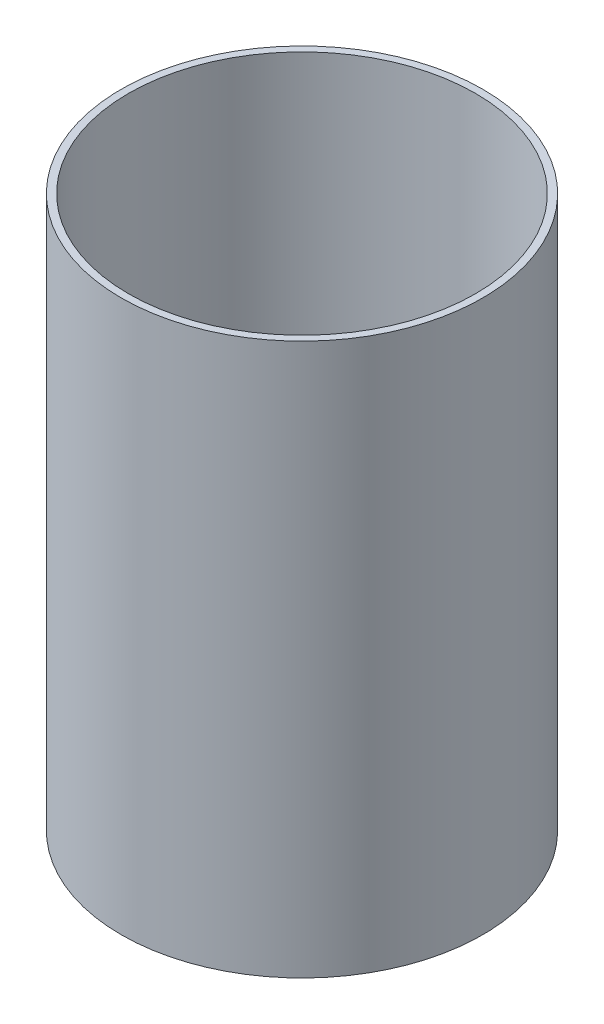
ISO-10303-21;
HEADER;
FILE_DESCRIPTION(('STEP AP214'),'2;1');
FILE_NAME('part.step','',(''),(''),'','','');
FILE_SCHEMA(('AUTOMOTIVE_DESIGN { 1 0 10303 214 1 1 1 1 }'));
ENDSEC;
DATA;
#1=APPLICATION_CONTEXT('core data for automotive mechanical design processes');
#2=APPLICATION_PROTOCOL_DEFINITION('international standard','automotive_design',2000,#1);
#3=PRODUCT_CONTEXT('',#1,'mechanical');
#4=PRODUCT('Part','Part','',(#3));
#5=PRODUCT_RELATED_PRODUCT_CATEGORY('part','',(#4));
#6=PRODUCT_DEFINITION_FORMATION('','',#4);
#7=PRODUCT_DEFINITION_CONTEXT('part definition',#1,'design');
#8=PRODUCT_DEFINITION('design','',#6,#7);
#9=PRODUCT_DEFINITION_SHAPE('','',#8);
#10=(LENGTH_UNIT() NAMED_UNIT(*) SI_UNIT(.MILLI.,.METRE.));
#11=(NAMED_UNIT(*) PLANE_ANGLE_UNIT() SI_UNIT($,.RADIAN.));
#12=(NAMED_UNIT(*) SI_UNIT($,.STERADIAN.) SOLID_ANGLE_UNIT());
#13=UNCERTAINTY_MEASURE_WITH_UNIT(LENGTH_MEASURE(1.E-05),#10,'distance_accuracy_value','');
#14=(GEOMETRIC_REPRESENTATION_CONTEXT(3) GLOBAL_UNCERTAINTY_ASSIGNED_CONTEXT((#13)) GLOBAL_UNIT_ASSIGNED_CONTEXT((#10,
#11,#12)) REPRESENTATION_CONTEXT('',''));
#15=CARTESIAN_POINT('',(0.,0.,0.));
#16=DIRECTION('',(0.,0.,1.));
#17=DIRECTION('',(1.,0.,0.));
#18=AXIS2_PLACEMENT_3D('',#15,#16,#17);
#19=CARTESIAN_POINT('',(0.,88.5300809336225,0.));
#20=DIRECTION('',(0.,1.,0.));
#21=DIRECTION('',(0.,0.,1.));
#22=AXIS2_PLACEMENT_3D('',#19,#20,#21);
#23=CYLINDRICAL_SURFACE('',#22,41.275);
#24=CARTESIAN_POINT('',(0.,62.9666,0.));
#25=DIRECTION('',(0.,1.,0.));
#26=DIRECTION('',(0.,0.,1.));
#27=AXIS2_PLACEMENT_3D('',#24,#25,#26);
#28=CIRCLE('',#27,41.275);
#29=CARTESIAN_POINT('',(0.,62.9666,41.275));
#30=VERTEX_POINT('',#29);
#31=EDGE_CURVE('E48',#30,#30,#28,.T.);
#32=ORIENTED_EDGE('',*,*,#31,.F.);
#33=EDGE_LOOP('',(#32));
#34=FACE_BOUND('',#33,.T.);
#35=CARTESIAN_POINT('',(0.,-62.9666,0.));
#36=DIRECTION('',(0.,1.,0.));
#37=DIRECTION('',(0.,0.,1.));
#38=AXIS2_PLACEMENT_3D('',#35,#36,#37);
#39=CIRCLE('',#38,41.275);
#40=CARTESIAN_POINT('',(0.,-62.9666,41.275));
#41=VERTEX_POINT('',#40);
#42=EDGE_CURVE('E10',#41,#41,#39,.T.);
#43=ORIENTED_EDGE('',*,*,#42,.T.);
#44=EDGE_LOOP('',(#43));
#45=FACE_BOUND('',#44,.T.);
#46=ADVANCED_FACE('F34',(#34,#45),#23,.T.);
#47=CARTESIAN_POINT('',(41.275,-62.9666,0.));
#48=DIRECTION('',(0.,1.,0.));
#49=DIRECTION('',(0.,0.,1.));
#50=AXIS2_PLACEMENT_3D('',#47,#48,#49);
#51=PLANE('',#50);
#52=ORIENTED_EDGE('',*,*,#42,.F.);
#53=EDGE_LOOP('',(#52));
#54=FACE_BOUND('',#53,.T.);
#55=CARTESIAN_POINT('',(0.,-62.9666,0.));
#56=DIRECTION('',(0.,1.,0.));
#57=DIRECTION('',(0.,0.,1.));
#58=AXIS2_PLACEMENT_3D('',#55,#56,#57);
#59=CIRCLE('',#58,39.624);
#60=CARTESIAN_POINT('',(0.,-62.9666,39.624));
#61=VERTEX_POINT('',#60);
#62=EDGE_CURVE('E40',#61,#61,#59,.T.);
#63=ORIENTED_EDGE('',*,*,#62,.T.);
#64=EDGE_LOOP('',(#63));
#65=FACE_BOUND('',#64,.T.);
#66=ADVANCED_FACE('F57',(#54,#65),#51,.F.);
#67=CARTESIAN_POINT('',(0.,88.5300809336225,0.));
#68=DIRECTION('',(0.,1.,0.));
#69=DIRECTION('',(0.,0.,1.));
#70=AXIS2_PLACEMENT_3D('',#67,#68,#69);
#71=CYLINDRICAL_SURFACE('',#70,39.624);
#72=ORIENTED_EDGE('',*,*,#62,.F.);
#73=EDGE_LOOP('',(#72));
#74=FACE_BOUND('',#73,.T.);
#75=CARTESIAN_POINT('',(0.,62.9666,0.));
#76=DIRECTION('',(0.,1.,0.));
#77=DIRECTION('',(0.,0.,1.));
#78=AXIS2_PLACEMENT_3D('',#75,#76,#77);
#79=CIRCLE('',#78,39.624);
#80=CARTESIAN_POINT('',(0.,62.9666,39.624));
#81=VERTEX_POINT('',#80);
#82=EDGE_CURVE('E44',#81,#81,#79,.T.);
#83=ORIENTED_EDGE('',*,*,#82,.T.);
#84=EDGE_LOOP('',(#83));
#85=FACE_BOUND('',#84,.T.);
#86=ADVANCED_FACE('F61',(#74,#85),#71,.F.);
#87=CARTESIAN_POINT('',(39.624,62.9666,0.));
#88=DIRECTION('',(0.,-1.,0.));
#89=DIRECTION('',(0.,0.,-1.));
#90=AXIS2_PLACEMENT_3D('',#87,#88,#89);
#91=PLANE('',#90);
#92=ORIENTED_EDGE('',*,*,#82,.F.);
#93=EDGE_LOOP('',(#92));
#94=FACE_BOUND('',#93,.T.);
#95=ORIENTED_EDGE('',*,*,#31,.T.);
#96=EDGE_LOOP('',(#95));
#97=FACE_BOUND('',#96,.T.);
#98=ADVANCED_FACE('F54',(#94,#97),#91,.F.);
#99=CLOSED_SHELL('',(#46,#66,#86,#98));
#100=MANIFOLD_SOLID_BREP('B2',#99);
#101=ADVANCED_BREP_SHAPE_REPRESENTATION('',(#18,#100),#14);
#102=SHAPE_DEFINITION_REPRESENTATION(#9,#101);
ENDSEC;
END-ISO-10303-21;
